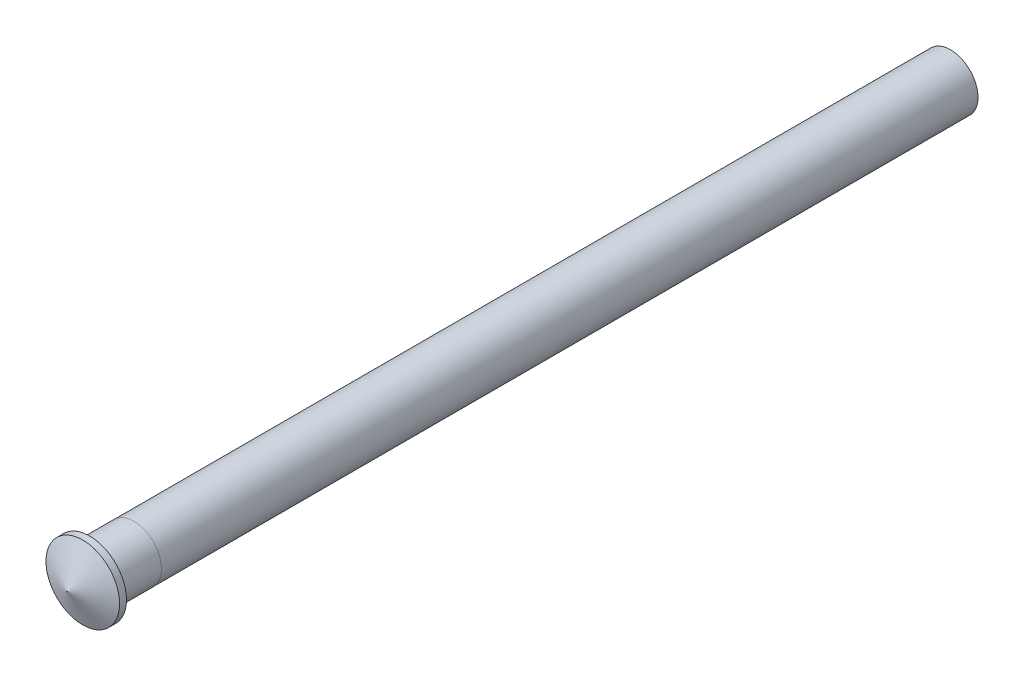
ISO-10303-21;
HEADER;
FILE_DESCRIPTION(('STEP AP214'),'2;1');
FILE_NAME('part.step','',(''),(''),'','','');
FILE_SCHEMA(('AUTOMOTIVE_DESIGN { 1 0 10303 214 1 1 1 1 }'));
ENDSEC;
DATA;
#1=APPLICATION_CONTEXT('core data for automotive mechanical design processes');
#2=APPLICATION_PROTOCOL_DEFINITION('international standard','automotive_design',2000,#1);
#3=PRODUCT_CONTEXT('',#1,'mechanical');
#4=PRODUCT('Part','Part','',(#3));
#5=PRODUCT_RELATED_PRODUCT_CATEGORY('part','',(#4));
#6=PRODUCT_DEFINITION_FORMATION('','',#4);
#7=PRODUCT_DEFINITION_CONTEXT('part definition',#1,'design');
#8=PRODUCT_DEFINITION('design','',#6,#7);
#9=PRODUCT_DEFINITION_SHAPE('','',#8);
#10=(LENGTH_UNIT() NAMED_UNIT(*) SI_UNIT(.MILLI.,.METRE.));
#11=(NAMED_UNIT(*) PLANE_ANGLE_UNIT() SI_UNIT($,.RADIAN.));
#12=(NAMED_UNIT(*) SI_UNIT($,.STERADIAN.) SOLID_ANGLE_UNIT());
#13=UNCERTAINTY_MEASURE_WITH_UNIT(LENGTH_MEASURE(1.E-05),#10,'distance_accuracy_value','');
#14=(GEOMETRIC_REPRESENTATION_CONTEXT(3) GLOBAL_UNCERTAINTY_ASSIGNED_CONTEXT((#13)) GLOBAL_UNIT_ASSIGNED_CONTEXT((#10,
#11,#12)) REPRESENTATION_CONTEXT('',''));
#15=CARTESIAN_POINT('',(0.,0.,0.));
#16=DIRECTION('',(0.,0.,1.));
#17=DIRECTION('',(1.,0.,0.));
#18=AXIS2_PLACEMENT_3D('',#15,#16,#17);
#19=CARTESIAN_POINT('',(0.,0.,-49.6062));
#20=DIRECTION('',(0.,0.,1.));
#21=DIRECTION('',(0.,-1.,0.));
#22=AXIS2_PLACEMENT_3D('',#19,#20,#21);
#23=CYLINDRICAL_SURFACE('',#22,4.7498);
#24=CARTESIAN_POINT('',(0.,0.,-7.62));
#25=DIRECTION('',(0.,0.,1.));
#26=DIRECTION('',(0.,-1.,0.));
#27=AXIS2_PLACEMENT_3D('',#24,#25,#26);
#28=CIRCLE('',#27,4.7498);
#29=CARTESIAN_POINT('',(0.,-4.74979999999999,-7.62));
#30=VERTEX_POINT('',#29);
#31=EDGE_CURVE('E10',#30,#30,#28,.F.);
#32=ORIENTED_EDGE('',*,*,#31,.T.);
#33=EDGE_LOOP('',(#32));
#34=FACE_BOUND('',#33,.T.);
#35=CARTESIAN_POINT('',(0.,0.,-148.536184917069));
#36=DIRECTION('',(0.,0.,1.));
#37=DIRECTION('',(1.,0.,0.));
#38=AXIS2_PLACEMENT_3D('',#35,#36,#37);
#39=CIRCLE('',#38,4.7498);
#40=CARTESIAN_POINT('',(4.7498,0.,-148.536184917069));
#41=VERTEX_POINT('',#40);
#42=EDGE_CURVE('E62',#41,#41,#39,.T.);
#43=ORIENTED_EDGE('',*,*,#42,.T.);
#44=EDGE_LOOP('',(#43));
#45=FACE_BOUND('',#44,.T.);
#46=ADVANCED_FACE('F37',(#34,#45),#23,.T.);
#47=CARTESIAN_POINT('',(0.,0.,-7.62));
#48=DIRECTION('',(0.,0.,1.));
#49=DIRECTION('',(0.,-1.,0.));
#50=AXIS2_PLACEMENT_3D('',#47,#48,#49);
#51=CYLINDRICAL_SURFACE('',#50,4.7625);
#52=CARTESIAN_POINT('',(0.,0.,-7.62));
#53=DIRECTION('',(0.,0.,1.));
#54=DIRECTION('',(1.,0.,0.));
#55=AXIS2_PLACEMENT_3D('',#52,#53,#54);
#56=CIRCLE('',#55,4.7625);
#57=CARTESIAN_POINT('',(4.7625,0.,-7.62));
#58=VERTEX_POINT('',#57);
#59=EDGE_CURVE('E43',#58,#58,#56,.T.);
#60=ORIENTED_EDGE('',*,*,#59,.T.);
#61=EDGE_LOOP('',(#60));
#62=FACE_BOUND('',#61,.T.);
#63=CARTESIAN_POINT('',(0.,0.,0.));
#64=DIRECTION('',(0.,0.,1.));
#65=DIRECTION('',(1.,0.,0.));
#66=AXIS2_PLACEMENT_3D('',#63,#64,#65);
#67=CIRCLE('',#66,4.7625);
#68=CARTESIAN_POINT('',(4.7625,0.,0.));
#69=VERTEX_POINT('',#68);
#70=EDGE_CURVE('E47',#69,#69,#67,.T.);
#71=ORIENTED_EDGE('',*,*,#70,.F.);
#72=EDGE_LOOP('',(#71));
#73=FACE_BOUND('',#72,.T.);
#74=ADVANCED_FACE('F78',(#62,#73),#51,.T.);
#75=CARTESIAN_POINT('',(0.,0.,-7.62));
#76=DIRECTION('',(0.,0.,1.));
#77=DIRECTION('',(0.,-1.,0.));
#78=AXIS2_PLACEMENT_3D('',#75,#76,#77);
#79=PLANE('',#78);
#80=ORIENTED_EDGE('',*,*,#31,.F.);
#81=EDGE_LOOP('',(#80));
#82=FACE_BOUND('',#81,.T.);
#83=ORIENTED_EDGE('',*,*,#59,.F.);
#84=EDGE_LOOP('',(#83));
#85=FACE_BOUND('',#84,.T.);
#86=ADVANCED_FACE('F83',(#82,#85),#79,.F.);
#87=CARTESIAN_POINT('',(0.,0.,0.));
#88=DIRECTION('',(0.,0.,1.));
#89=DIRECTION('',(0.,-1.,0.));
#90=AXIS2_PLACEMENT_3D('',#87,#88,#89);
#91=PLANE('',#90);
#92=CARTESIAN_POINT('',(0.,0.,0.));
#93=DIRECTION('',(0.,0.,1.));
#94=DIRECTION('',(1.,0.,0.));
#95=AXIS2_PLACEMENT_3D('',#92,#93,#94);
#96=CIRCLE('',#95,6.35);
#97=CARTESIAN_POINT('',(6.35,0.,0.));
#98=VERTEX_POINT('',#97);
#99=EDGE_CURVE('E56',#98,#98,#96,.T.);
#100=ORIENTED_EDGE('',*,*,#99,.F.);
#101=EDGE_LOOP('',(#100));
#102=FACE_BOUND('',#101,.T.);
#103=ORIENTED_EDGE('',*,*,#70,.T.);
#104=EDGE_LOOP('',(#103));
#105=FACE_BOUND('',#104,.T.);
#106=ADVANCED_FACE('F89',(#102,#105),#91,.F.);
#107=CARTESIAN_POINT('',(0.,0.,1.1938));
#108=DIRECTION('',(0.,0.,-1.));
#109=DIRECTION('',(0.,1.,0.));
#110=AXIS2_PLACEMENT_3D('',#107,#108,#109);
#111=CYLINDRICAL_SURFACE('',#110,6.35);
#112=CARTESIAN_POINT('',(0.,0.,1.1938));
#113=DIRECTION('',(0.,0.,1.));
#114=DIRECTION('',(1.,0.,0.));
#115=AXIS2_PLACEMENT_3D('',#112,#113,#114);
#116=CIRCLE('',#115,6.35);
#117=CARTESIAN_POINT('',(0.,-6.35,1.1938));
#118=VERTEX_POINT('',#117);
#119=EDGE_CURVE('E51',#118,#118,#116,.T.);
#120=ORIENTED_EDGE('',*,*,#119,.F.);
#121=EDGE_LOOP('',(#120));
#122=FACE_BOUND('',#121,.T.);
#123=ORIENTED_EDGE('',*,*,#99,.T.);
#124=EDGE_LOOP('',(#123));
#125=FACE_BOUND('',#124,.T.);
#126=ADVANCED_FACE('F94',(#122,#125),#111,.T.);
#127=CARTESIAN_POINT('',(0.,0.,1.1938));
#128=DIRECTION('',(0.,0.,-1.));
#129=DIRECTION('',(0.,-1.,0.));
#130=AXIS2_PLACEMENT_3D('',#127,#128,#129);
#131=CONICAL_SURFACE('',#130,6.35,1.1693705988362);
#132=CARTESIAN_POINT('',(0.,0.,3.863815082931));
#133=DIRECTION('',(0.,0.,1.));
#134=DIRECTION('',(0.,-1.,0.));
#135=AXIS2_PLACEMENT_3D('',#132,#133,#134);
#136=CIRCLE('',#135,0.0598386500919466);
#137=CARTESIAN_POINT('',(0.,-0.0598386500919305,3.863815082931));
#138=VERTEX_POINT('',#137);
#139=EDGE_CURVE('E59',#138,#138,#136,.T.);
#140=CARTESIAN_POINT('',(0.,-0.0598386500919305,3.863815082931));
#141=CARTESIAN_POINT('',(0.,-0.125361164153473,3.83600242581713));
#142=CARTESIAN_POINT('',(0.,-0.190883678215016,3.80818976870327));
#143=CARTESIAN_POINT('',(0.,-0.321928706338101,3.75256445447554));
#144=CARTESIAN_POINT('',(0.,-0.387451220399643,3.72475179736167));
#145=CARTESIAN_POINT('',(0.,-0.518496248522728,3.66912648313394));
#146=CARTESIAN_POINT('',(0.,-0.58401876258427,3.64131382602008));
#147=CARTESIAN_POINT('',(0.,-0.715063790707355,3.58568851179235));
#148=CARTESIAN_POINT('',(0.,-0.780586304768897,3.55787585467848));
#149=CARTESIAN_POINT('',(0.,-0.911631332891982,3.50225054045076));
#150=CARTESIAN_POINT('',(0.,-0.977153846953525,3.47443788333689));
#151=CARTESIAN_POINT('',(0.,-1.10819887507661,3.41881256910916));
#152=CARTESIAN_POINT('',(0.,-1.17372138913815,3.3909999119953));
#153=CARTESIAN_POINT('',(0.,-1.30476641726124,3.33537459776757));
#154=CARTESIAN_POINT('',(0.,-1.37028893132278,3.3075619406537));
#155=CARTESIAN_POINT('',(0.,-1.50133395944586,3.25193662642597));
#156=CARTESIAN_POINT('',(0.,-1.56685647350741,3.22412396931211));
#157=CARTESIAN_POINT('',(0.,-1.69790150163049,3.16849865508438));
#158=CARTESIAN_POINT('',(0.,-1.76342401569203,3.14068599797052));
#159=CARTESIAN_POINT('',(0.,-1.89446904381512,3.08506068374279));
#160=CARTESIAN_POINT('',(0.,-1.95999155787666,3.05724802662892));
#161=CARTESIAN_POINT('',(0.,-2.09103658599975,3.00162271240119));
#162=CARTESIAN_POINT('',(0.,-2.15655910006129,2.97381005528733));
#163=CARTESIAN_POINT('',(0.,-2.28760412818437,2.9181847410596));
#164=CARTESIAN_POINT('',(0.,-2.35312664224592,2.89037208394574));
#165=CARTESIAN_POINT('',(0.,-2.484171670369,2.83474676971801));
#166=CARTESIAN_POINT('',(0.,-2.54969418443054,2.80693411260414));
#167=CARTESIAN_POINT('',(0.,-2.68073921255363,2.75130879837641));
#168=CARTESIAN_POINT('',(0.,-2.74626172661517,2.72349614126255));
#169=CARTESIAN_POINT('',(0.,-2.87730675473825,2.66787082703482));
#170=CARTESIAN_POINT('',(0.,-2.9428292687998,2.64005816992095));
#171=CARTESIAN_POINT('',(0.,-3.07387429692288,2.58443285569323));
#172=CARTESIAN_POINT('',(0.,-3.13939681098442,2.55662019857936));
#173=CARTESIAN_POINT('',(0.,-3.27044183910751,2.50099488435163));
#174=CARTESIAN_POINT('',(0.,-3.33596435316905,2.47318222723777));
#175=CARTESIAN_POINT('',(0.,-3.46700938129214,2.41755691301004));
#176=CARTESIAN_POINT('',(0.,-3.53253189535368,2.38974425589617));
#177=CARTESIAN_POINT('',(0.,-3.66357692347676,2.33411894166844));
#178=CARTESIAN_POINT('',(0.,-3.72909943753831,2.30630628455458));
#179=CARTESIAN_POINT('',(0.,-3.86014446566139,2.25068097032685));
#180=CARTESIAN_POINT('',(0.,-3.92566697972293,2.22286831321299));
#181=CARTESIAN_POINT('',(0.,-4.05671200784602,2.16724299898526));
#182=CARTESIAN_POINT('',(0.,-4.12223452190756,2.13943034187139));
#183=CARTESIAN_POINT('',(0.,-4.25327955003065,2.08380502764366));
#184=CARTESIAN_POINT('',(0.,-4.31880206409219,2.0559923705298));
#185=CARTESIAN_POINT('',(0.,-4.44984709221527,2.00036705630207));
#186=CARTESIAN_POINT('',(0.,-4.51536960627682,1.97255439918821));
#187=CARTESIAN_POINT('',(0.,-4.6464146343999,1.91692908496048));
#188=CARTESIAN_POINT('',(0.,-4.71193714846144,1.88911642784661));
#189=CARTESIAN_POINT('',(0.,-4.84298217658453,1.83349111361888));
#190=CARTESIAN_POINT('',(0.,-4.90850469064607,1.80567845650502));
#191=CARTESIAN_POINT('',(0.,-5.03954971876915,1.75005314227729));
#192=CARTESIAN_POINT('',(0.,-5.1050722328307,1.72224048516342));
#193=CARTESIAN_POINT('',(0.,-5.23611726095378,1.66661517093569));
#194=CARTESIAN_POINT('',(0.,-5.30163977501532,1.63880251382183));
#195=CARTESIAN_POINT('',(0.,-5.43268480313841,1.5831771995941));
#196=CARTESIAN_POINT('',(0.,-5.49820731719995,1.55536454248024));
#197=CARTESIAN_POINT('',(0.,-5.62925234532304,1.49973922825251));
#198=CARTESIAN_POINT('',(0.,-5.69477485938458,1.47192657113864));
#199=CARTESIAN_POINT('',(0.,-5.82581988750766,1.41630125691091));
#200=CARTESIAN_POINT('',(0.,-5.89134240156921,1.38848859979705));
#201=CARTESIAN_POINT('',(0.,-6.02238742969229,1.33286328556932));
#202=CARTESIAN_POINT('',(0.,-6.08790994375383,1.30505062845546));
#203=CARTESIAN_POINT('',(0.,-6.21895497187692,1.24942531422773));
#204=CARTESIAN_POINT('',(0.,-6.28447748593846,1.22161265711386));
#205=CARTESIAN_POINT('',(0.,-6.35,1.1938));
#206=B_SPLINE_CURVE_WITH_KNOTS('',3,(#140,#141,#142,#143,#144,#145,#146,#147,#148,#149,#150,
#151,#152,#153,#154,#155,#156,#157,#158,#159,#160,#161,#162,#163,#164,#165,#166,#167,#168,#169,
#170,#171,#172,#173,#174,#175,#176,#177,#178,#179,#180,#181,#182,#183,#184,#185,#186,#187,#188,
#189,#190,#191,#192,#193,#194,#195,#196,#197,#198,#199,#200,#201,#202,#203,#204,#205),
.UNSPECIFIED.,.F.,.F.,(4,2,2,2,2,2,2,2,2,2,2,2,2,2,2,2,2,2,2,2,2,2,2,2,2,2,2,2,2,2,2,2,4),(0.,
0.213543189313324,0.427086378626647,0.64062956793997,0.854172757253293,1.06771594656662,
1.28125913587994,1.49480232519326,1.70834551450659,1.92188870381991,2.13543189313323,
2.34897508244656,2.56251827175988,2.7760614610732,2.98960465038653,3.20314783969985,
3.41669102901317,3.6302342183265,3.84377740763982,4.05732059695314,4.27086378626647,
4.48440697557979,4.69795016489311,4.91149335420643,5.12503654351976,5.33857973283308,
5.55212292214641,5.76566611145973,5.97920930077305,6.19275249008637,6.4062956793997,
6.61983886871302,6.83338205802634),.UNSPECIFIED.);
#207=EDGE_CURVE('BSEAM75',#138,#118,#206,.T.);
#208=ORIENTED_EDGE('',*,*,#139,.F.);
#209=ORIENTED_EDGE('',*,*,#119,.T.);
#210=ORIENTED_EDGE('',*,*,#207,.T.);
#211=ORIENTED_EDGE('',*,*,#207,.F.);
#212=EDGE_LOOP('',(#208,#210,#209,#211));
#213=FACE_BOUND('',#212,.T.);
#214=ADVANCED_FACE('F75',(#213),#131,.T.);
#215=CARTESIAN_POINT('',(0.,0.,3.863815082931));
#216=DIRECTION('',(0.,0.,1.));
#217=DIRECTION('',(0.,-1.,0.));
#218=AXIS2_PLACEMENT_3D('',#215,#216,#217);
#219=PLANE('',#218);
#220=ORIENTED_EDGE('',*,*,#139,.T.);
#221=EDGE_LOOP('',(#220));
#222=FACE_BOUND('',#221,.T.);
#223=ADVANCED_FACE('F69',(#222),#219,.T.);
#224=CARTESIAN_POINT('',(-4.7498,0.,-148.536184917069));
#225=DIRECTION('',(0.,0.,1.));
#226=DIRECTION('',(1.,0.,0.));
#227=AXIS2_PLACEMENT_3D('',#224,#225,#226);
#228=PLANE('',#227);
#229=ORIENTED_EDGE('',*,*,#42,.F.);
#230=EDGE_LOOP('',(#229));
#231=FACE_BOUND('',#230,.T.);
#232=ADVANCED_FACE('F67',(#231),#228,.F.);
#233=CLOSED_SHELL('',(#46,#74,#86,#106,#126,#214,#223,#232));
#234=MANIFOLD_SOLID_BREP('B2',#233);
#235=ADVANCED_BREP_SHAPE_REPRESENTATION('',(#18,#234),#14);
#236=SHAPE_DEFINITION_REPRESENTATION(#9,#235);
ENDSEC;
END-ISO-10303-21;
